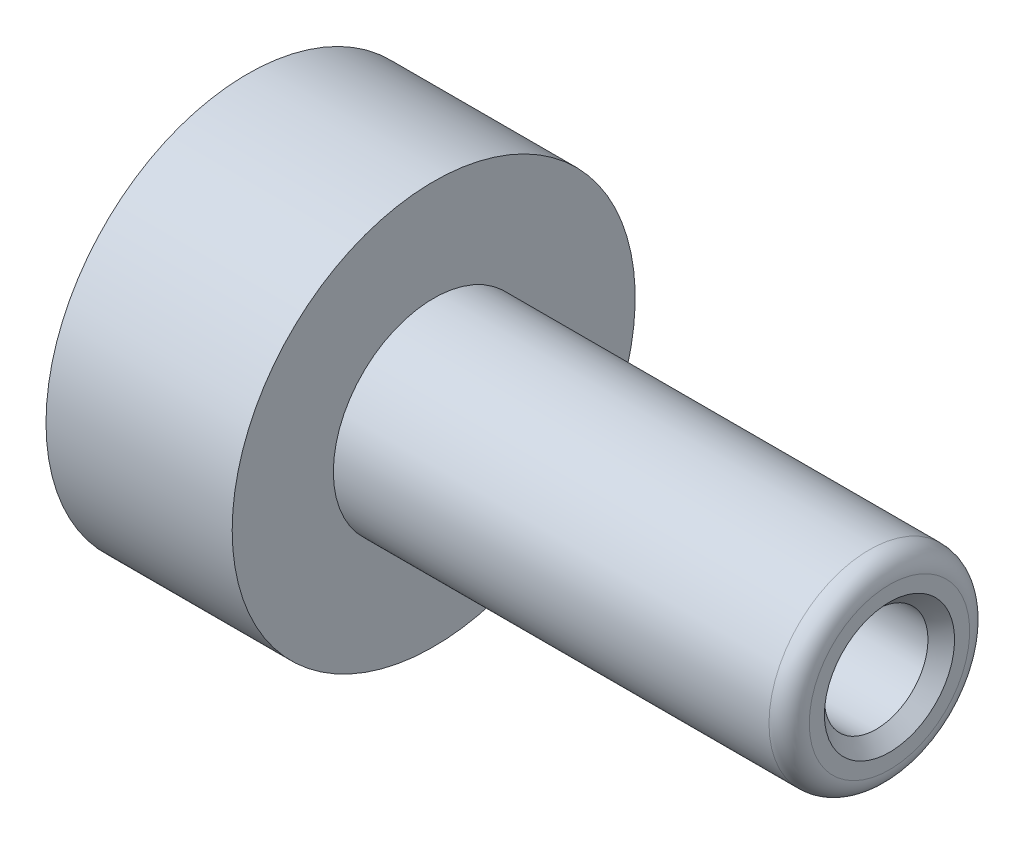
ISO-10303-21;
HEADER;
FILE_DESCRIPTION(('STEP AP214'),'2;1');
FILE_NAME('part.step','',(''),(''),'','','');
FILE_SCHEMA(('AUTOMOTIVE_DESIGN { 1 0 10303 214 1 1 1 1 }'));
ENDSEC;
DATA;
#1=APPLICATION_CONTEXT('core data for automotive mechanical design processes');
#2=APPLICATION_PROTOCOL_DEFINITION('international standard','automotive_design',2000,#1);
#3=PRODUCT_CONTEXT('',#1,'mechanical');
#4=PRODUCT('Part','Part','',(#3));
#5=PRODUCT_RELATED_PRODUCT_CATEGORY('part','',(#4));
#6=PRODUCT_DEFINITION_FORMATION('','',#4);
#7=PRODUCT_DEFINITION_CONTEXT('part definition',#1,'design');
#8=PRODUCT_DEFINITION('design','',#6,#7);
#9=PRODUCT_DEFINITION_SHAPE('','',#8);
#10=(LENGTH_UNIT() NAMED_UNIT(*) SI_UNIT(.MILLI.,.METRE.));
#11=(NAMED_UNIT(*) PLANE_ANGLE_UNIT() SI_UNIT($,.RADIAN.));
#12=(NAMED_UNIT(*) SI_UNIT($,.STERADIAN.) SOLID_ANGLE_UNIT());
#13=UNCERTAINTY_MEASURE_WITH_UNIT(LENGTH_MEASURE(1.E-05),#10,'distance_accuracy_value','');
#14=(GEOMETRIC_REPRESENTATION_CONTEXT(3) GLOBAL_UNCERTAINTY_ASSIGNED_CONTEXT((#13)) GLOBAL_UNIT_ASSIGNED_CONTEXT((#10,
#11,#12)) REPRESENTATION_CONTEXT('',''));
#15=CARTESIAN_POINT('',(0.,0.,0.));
#16=DIRECTION('',(0.,0.,1.));
#17=DIRECTION('',(1.,0.,0.));
#18=AXIS2_PLACEMENT_3D('',#15,#16,#17);
#19=CARTESIAN_POINT('',(0.,0.,0.));
#20=DIRECTION('',(-1.,0.,0.));
#21=DIRECTION('',(0.,0.,1.));
#22=AXIS2_PLACEMENT_3D('',#19,#20,#21);
#23=CYLINDRICAL_SURFACE('',#22,3.9751);
#24=CARTESIAN_POINT('',(21.7678,0.,0.));
#25=DIRECTION('',(-1.,0.,0.));
#26=DIRECTION('',(0.,0.,1.));
#27=AXIS2_PLACEMENT_3D('',#24,#25,#26);
#28=CIRCLE('',#27,3.9751);
#29=CARTESIAN_POINT('',(21.7678,0.,3.9751));
#30=VERTEX_POINT('',#29);
#31=EDGE_CURVE('E45',#30,#30,#28,.T.);
#32=ORIENTED_EDGE('',*,*,#31,.F.);
#33=EDGE_LOOP('',(#32));
#34=FACE_BOUND('',#33,.T.);
#35=CARTESIAN_POINT('',(0.,0.,0.));
#36=DIRECTION('',(-1.,0.,0.));
#37=DIRECTION('',(0.,0.,1.));
#38=AXIS2_PLACEMENT_3D('',#35,#36,#37);
#39=CIRCLE('',#38,3.9751);
#40=CARTESIAN_POINT('',(0.,0.,3.9751));
#41=VERTEX_POINT('',#40);
#42=EDGE_CURVE('E66',#41,#41,#39,.T.);
#43=ORIENTED_EDGE('',*,*,#42,.T.);
#44=EDGE_LOOP('',(#43));
#45=FACE_BOUND('',#44,.T.);
#46=ADVANCED_FACE('F34',(#34,#45),#23,.F.);
#47=CARTESIAN_POINT('',(21.7678,3.9751,0.));
#48=DIRECTION('',(1.,0.,0.));
#49=DIRECTION('',(0.,0.,-1.));
#50=AXIS2_PLACEMENT_3D('',#47,#48,#49);
#51=PLANE('',#50);
#52=ORIENTED_EDGE('',*,*,#31,.T.);
#53=EDGE_LOOP('',(#52));
#54=FACE_BOUND('',#53,.T.);
#55=ADVANCED_FACE('F100',(#54),#51,.F.);
#56=CARTESIAN_POINT('',(40.4622,5.0546,0.));
#57=DIRECTION('',(-1.,0.,0.));
#58=DIRECTION('',(0.,0.,1.));
#59=AXIS2_PLACEMENT_3D('',#56,#57,#58);
#60=PLANE('',#59);
#61=CARTESIAN_POINT('',(40.4622,0.,0.));
#62=DIRECTION('',(-1.,0.,0.));
#63=DIRECTION('',(0.,0.,1.));
#64=AXIS2_PLACEMENT_3D('',#61,#62,#63);
#65=CIRCLE('',#64,4.10209999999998);
#66=CARTESIAN_POINT('',(40.4622,0.,4.10209999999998));
#67=VERTEX_POINT('',#66);
#68=EDGE_CURVE('E10',#67,#67,#65,.T.);
#69=ORIENTED_EDGE('',*,*,#68,.T.);
#70=EDGE_LOOP('',(#69));
#71=FACE_BOUND('',#70,.T.);
#72=CARTESIAN_POINT('',(40.4622,0.,0.));
#73=DIRECTION('',(-1.,0.,0.));
#74=DIRECTION('',(0.,0.,1.));
#75=AXIS2_PLACEMENT_3D('',#72,#73,#74);
#76=CIRCLE('',#75,5.0546);
#77=CARTESIAN_POINT('',(40.4622,0.,5.0546));
#78=VERTEX_POINT('',#77);
#79=EDGE_CURVE('E49',#78,#78,#76,.T.);
#80=ORIENTED_EDGE('',*,*,#79,.F.);
#81=EDGE_LOOP('',(#80));
#82=FACE_BOUND('',#81,.T.);
#83=ADVANCED_FACE('F105',(#71,#82),#60,.F.);
#84=CARTESIAN_POINT('',(39.1922,0.,0.));
#85=DIRECTION('',(-1.,0.,0.));
#86=DIRECTION('',(0.,0.,1.));
#87=AXIS2_PLACEMENT_3D('',#84,#85,#86);
#88=TOROIDAL_SURFACE('',#87,5.0546,1.27);
#89=CARTESIAN_POINT('',(39.1922,0.,0.));
#90=DIRECTION('',(-1.,0.,0.));
#91=DIRECTION('',(0.,0.,1.));
#92=AXIS2_PLACEMENT_3D('',#89,#90,#91);
#93=CIRCLE('',#92,6.3246);
#94=CARTESIAN_POINT('',(39.1922,0.,6.3246));
#95=VERTEX_POINT('',#94);
#96=EDGE_CURVE('E54',#95,#95,#93,.T.);
#97=ORIENTED_EDGE('',*,*,#96,.F.);
#98=EDGE_LOOP('',(#97));
#99=FACE_BOUND('',#98,.T.);
#100=ORIENTED_EDGE('',*,*,#79,.T.);
#101=EDGE_LOOP('',(#100));
#102=FACE_BOUND('',#101,.T.);
#103=ADVANCED_FACE('F113',(#99,#102),#88,.T.);
#104=CARTESIAN_POINT('',(0.,0.,0.));
#105=DIRECTION('',(-1.,0.,0.));
#106=DIRECTION('',(0.,0.,1.));
#107=AXIS2_PLACEMENT_3D('',#104,#105,#106);
#108=CYLINDRICAL_SURFACE('',#107,6.3246);
#109=CARTESIAN_POINT('',(11.7348,0.,0.));
#110=DIRECTION('',(-1.,0.,0.));
#111=DIRECTION('',(0.,0.,1.));
#112=AXIS2_PLACEMENT_3D('',#109,#110,#111);
#113=CIRCLE('',#112,6.3246);
#114=CARTESIAN_POINT('',(11.7348,0.,6.3246));
#115=VERTEX_POINT('',#114);
#116=EDGE_CURVE('E57',#115,#115,#113,.T.);
#117=ORIENTED_EDGE('',*,*,#116,.F.);
#118=EDGE_LOOP('',(#117));
#119=FACE_BOUND('',#118,.T.);
#120=ORIENTED_EDGE('',*,*,#96,.T.);
#121=EDGE_LOOP('',(#120));
#122=FACE_BOUND('',#121,.T.);
#123=ADVANCED_FACE('F116',(#119,#122),#108,.T.);
#124=CARTESIAN_POINT('',(11.7348,12.7,0.));
#125=DIRECTION('',(-1.,0.,0.));
#126=DIRECTION('',(0.,0.,1.));
#127=AXIS2_PLACEMENT_3D('',#124,#125,#126);
#128=PLANE('',#127);
#129=CARTESIAN_POINT('',(11.7348,0.,0.));
#130=DIRECTION('',(-1.,0.,0.));
#131=DIRECTION('',(0.,0.,1.));
#132=AXIS2_PLACEMENT_3D('',#129,#130,#131);
#133=CIRCLE('',#132,12.7);
#134=CARTESIAN_POINT('',(11.7348,0.,12.7));
#135=VERTEX_POINT('',#134);
#136=EDGE_CURVE('E60',#135,#135,#133,.T.);
#137=ORIENTED_EDGE('',*,*,#136,.F.);
#138=EDGE_LOOP('',(#137));
#139=FACE_BOUND('',#138,.T.);
#140=ORIENTED_EDGE('',*,*,#116,.T.);
#141=EDGE_LOOP('',(#140));
#142=FACE_BOUND('',#141,.T.);
#143=ADVANCED_FACE('F120',(#139,#142),#128,.F.);
#144=CARTESIAN_POINT('',(0.,0.,0.));
#145=DIRECTION('',(-1.,0.,0.));
#146=DIRECTION('',(0.,0.,1.));
#147=AXIS2_PLACEMENT_3D('',#144,#145,#146);
#148=CYLINDRICAL_SURFACE('',#147,12.7);
#149=CARTESIAN_POINT('',(0.,0.,0.));
#150=DIRECTION('',(-1.,0.,0.));
#151=DIRECTION('',(0.,0.,1.));
#152=AXIS2_PLACEMENT_3D('',#149,#150,#151);
#153=CIRCLE('',#152,12.7);
#154=CARTESIAN_POINT('',(0.,0.,12.7));
#155=VERTEX_POINT('',#154);
#156=EDGE_CURVE('E63',#155,#155,#153,.T.);
#157=ORIENTED_EDGE('',*,*,#156,.F.);
#158=EDGE_LOOP('',(#157));
#159=FACE_BOUND('',#158,.T.);
#160=ORIENTED_EDGE('',*,*,#136,.T.);
#161=EDGE_LOOP('',(#160));
#162=FACE_BOUND('',#161,.T.);
#163=ADVANCED_FACE('F124',(#159,#162),#148,.T.);
#164=CARTESIAN_POINT('',(0.,3.9751,0.));
#165=DIRECTION('',(1.,0.,0.));
#166=DIRECTION('',(0.,0.,-1.));
#167=AXIS2_PLACEMENT_3D('',#164,#165,#166);
#168=PLANE('',#167);
#169=CARTESIAN_POINT('',(0.,-7.1374,0.));
#170=DIRECTION('',(-1.,0.,0.));
#171=DIRECTION('',(0.,0.,-1.));
#172=AXIS2_PLACEMENT_3D('',#169,#170,#171);
#173=CIRCLE('',#172,1.6129);
#174=CARTESIAN_POINT('',(0.,-7.1374,-1.6129));
#175=VERTEX_POINT('',#174);
#176=EDGE_CURVE('E76',#175,#175,#173,.T.);
#177=ORIENTED_EDGE('',*,*,#176,.F.);
#178=EDGE_LOOP('',(#177));
#179=FACE_BOUND('',#178,.T.);
#180=CARTESIAN_POINT('',(0.,7.1374,0.));
#181=DIRECTION('',(-1.,0.,0.));
#182=DIRECTION('',(0.,0.,1.));
#183=AXIS2_PLACEMENT_3D('',#180,#181,#182);
#184=CIRCLE('',#183,1.6129);
#185=CARTESIAN_POINT('',(0.,7.1374,1.6129));
#186=VERTEX_POINT('',#185);
#187=EDGE_CURVE('E70',#186,#186,#184,.T.);
#188=ORIENTED_EDGE('',*,*,#187,.F.);
#189=EDGE_LOOP('',(#188));
#190=FACE_BOUND('',#189,.T.);
#191=ORIENTED_EDGE('',*,*,#42,.F.);
#192=EDGE_LOOP('',(#191));
#193=FACE_BOUND('',#192,.T.);
#194=ORIENTED_EDGE('',*,*,#156,.T.);
#195=EDGE_LOOP('',(#194));
#196=FACE_BOUND('',#195,.T.);
#197=ADVANCED_FACE('F128',(#179,#190,#193,#196),#168,.F.);
#198=CARTESIAN_POINT('',(6.35,7.1374,0.));
#199=DIRECTION('',(-1.,0.,0.));
#200=DIRECTION('',(0.,0.,1.));
#201=AXIS2_PLACEMENT_3D('',#198,#199,#200);
#202=CYLINDRICAL_SURFACE('',#201,1.6129);
#203=CARTESIAN_POINT('',(6.35,7.1374,0.));
#204=DIRECTION('',(-1.,0.,0.));
#205=DIRECTION('',(0.,0.,1.));
#206=AXIS2_PLACEMENT_3D('',#203,#204,#205);
#207=CIRCLE('',#206,1.6129);
#208=CARTESIAN_POINT('',(6.35,7.1374,1.6129));
#209=VERTEX_POINT('',#208);
#210=EDGE_CURVE('E69',#209,#209,#207,.T.);
#211=ORIENTED_EDGE('',*,*,#210,.F.);
#212=EDGE_LOOP('',(#211));
#213=FACE_BOUND('',#212,.T.);
#214=ORIENTED_EDGE('',*,*,#187,.T.);
#215=EDGE_LOOP('',(#214));
#216=FACE_BOUND('',#215,.T.);
#217=ADVANCED_FACE('F132',(#213,#216),#202,.F.);
#218=CARTESIAN_POINT('',(6.35,7.1374,0.));
#219=DIRECTION('',(-1.,0.,0.));
#220=DIRECTION('',(0.,0.,1.));
#221=AXIS2_PLACEMENT_3D('',#218,#219,#220);
#222=PLANE('',#221);
#223=ORIENTED_EDGE('',*,*,#210,.T.);
#224=EDGE_LOOP('',(#223));
#225=FACE_BOUND('',#224,.T.);
#226=ADVANCED_FACE('F136',(#225),#222,.T.);
#227=CARTESIAN_POINT('',(6.35,-7.1374,0.));
#228=DIRECTION('',(-1.,0.,0.));
#229=DIRECTION('',(0.,0.,1.));
#230=AXIS2_PLACEMENT_3D('',#227,#228,#229);
#231=CYLINDRICAL_SURFACE('',#230,1.6129);
#232=CARTESIAN_POINT('',(6.35,-7.1374,0.));
#233=DIRECTION('',(-1.,0.,0.));
#234=DIRECTION('',(0.,0.,-1.));
#235=AXIS2_PLACEMENT_3D('',#232,#233,#234);
#236=CIRCLE('',#235,1.6129);
#237=CARTESIAN_POINT('',(6.35,-7.1374,-1.6129));
#238=VERTEX_POINT('',#237);
#239=EDGE_CURVE('E73',#238,#238,#236,.T.);
#240=ORIENTED_EDGE('',*,*,#239,.F.);
#241=EDGE_LOOP('',(#240));
#242=FACE_BOUND('',#241,.T.);
#243=ORIENTED_EDGE('',*,*,#176,.T.);
#244=EDGE_LOOP('',(#243));
#245=FACE_BOUND('',#244,.T.);
#246=ADVANCED_FACE('F96',(#242,#245),#231,.F.);
#247=CARTESIAN_POINT('',(6.35,-7.1374,0.));
#248=DIRECTION('',(1.,0.,0.));
#249=DIRECTION('',(0.,0.,-1.));
#250=AXIS2_PLACEMENT_3D('',#247,#248,#249);
#251=PLANE('',#250);
#252=ORIENTED_EDGE('',*,*,#239,.T.);
#253=EDGE_LOOP('',(#252));
#254=FACE_BOUND('',#253,.T.);
#255=ADVANCED_FACE('F89',(#254),#251,.F.);
#256=CARTESIAN_POINT('',(24.6634,0.,0.));
#257=DIRECTION('',(1.,0.,0.));
#258=DIRECTION('',(0.,0.,-1.));
#259=AXIS2_PLACEMENT_3D('',#256,#257,#258);
#260=CYLINDRICAL_SURFACE('',#259,3.2639);
#261=CARTESIAN_POINT('',(39.624,0.,0.));
#262=DIRECTION('',(-1.,0.,0.));
#263=DIRECTION('',(0.,0.,1.));
#264=AXIS2_PLACEMENT_3D('',#261,#262,#263);
#265=CIRCLE('',#264,3.2639);
#266=CARTESIAN_POINT('',(39.624,0.,3.2639));
#267=VERTEX_POINT('',#266);
#268=EDGE_CURVE('E41',#267,#267,#265,.F.);
#269=ORIENTED_EDGE('',*,*,#268,.T.);
#270=EDGE_LOOP('',(#269));
#271=FACE_BOUND('',#270,.T.);
#272=CARTESIAN_POINT('',(24.6634,0.,0.));
#273=DIRECTION('',(1.,0.,0.));
#274=DIRECTION('',(0.,0.,-1.));
#275=AXIS2_PLACEMENT_3D('',#272,#273,#274);
#276=CIRCLE('',#275,3.2639);
#277=CARTESIAN_POINT('',(24.6634,0.,-3.2639));
#278=VERTEX_POINT('',#277);
#279=EDGE_CURVE('E79',#278,#278,#276,.T.);
#280=ORIENTED_EDGE('',*,*,#279,.F.);
#281=EDGE_LOOP('',(#280));
#282=FACE_BOUND('',#281,.T.);
#283=ADVANCED_FACE('F87',(#271,#282),#260,.F.);
#284=CARTESIAN_POINT('',(24.6634,0.,0.));
#285=DIRECTION('',(1.,0.,0.));
#286=DIRECTION('',(0.,0.,-1.));
#287=AXIS2_PLACEMENT_3D('',#284,#285,#286);
#288=PLANE('',#287);
#289=ORIENTED_EDGE('',*,*,#279,.T.);
#290=EDGE_LOOP('',(#289));
#291=FACE_BOUND('',#290,.T.);
#292=ADVANCED_FACE('F85',(#291),#288,.T.);
#293=CARTESIAN_POINT('',(39.624,0.,0.));
#294=DIRECTION('',(1.,0.,0.));
#295=DIRECTION('',(0.,0.,-1.));
#296=AXIS2_PLACEMENT_3D('',#293,#294,#295);
#297=CONICAL_SURFACE('',#296,3.2639,0.785398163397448);
#298=ORIENTED_EDGE('',*,*,#68,.F.);
#299=EDGE_LOOP('',(#298));
#300=FACE_BOUND('',#299,.T.);
#301=ORIENTED_EDGE('',*,*,#268,.F.);
#302=EDGE_LOOP('',(#301));
#303=FACE_BOUND('',#302,.T.);
#304=ADVANCED_FACE('F36',(#300,#303),#297,.F.);
#305=CLOSED_SHELL('',(#46,#55,#83,#103,#123,#143,#163,#197,#217,#226,#246,#255,#283,#292,#304));
#306=MANIFOLD_SOLID_BREP('B2',#305);
#307=ADVANCED_BREP_SHAPE_REPRESENTATION('',(#18,#306),#14);
#308=SHAPE_DEFINITION_REPRESENTATION(#9,#307);
ENDSEC;
END-ISO-10303-21;
